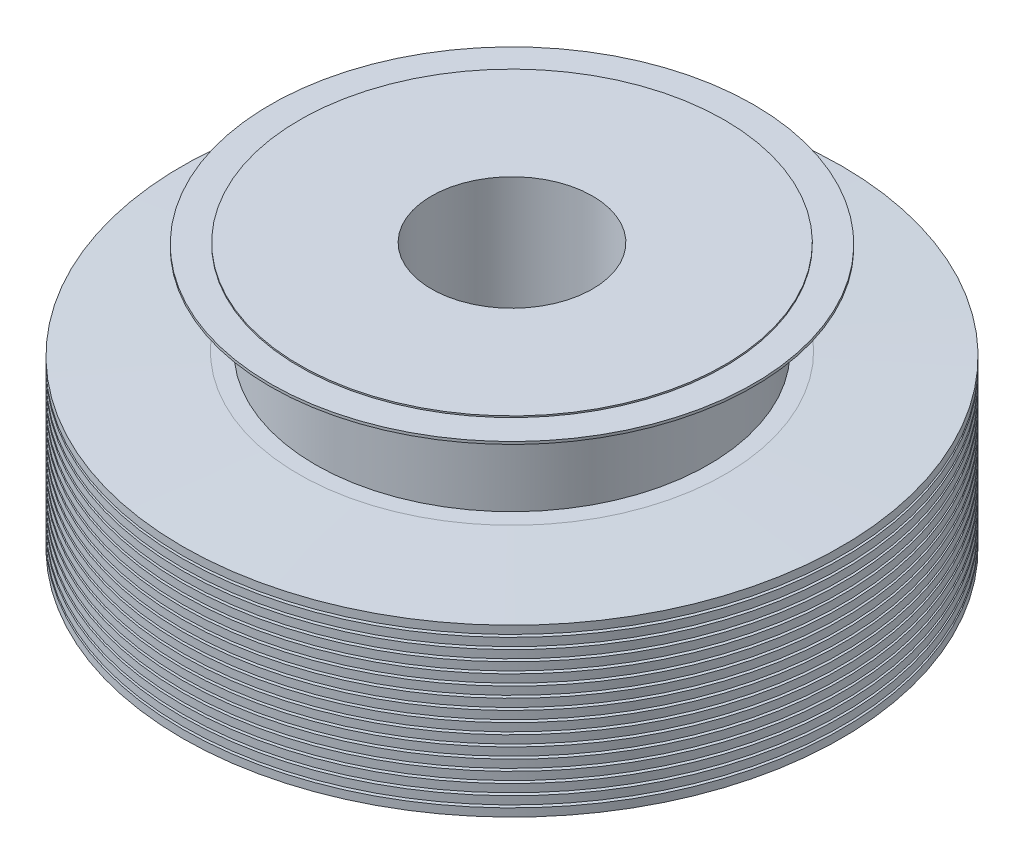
ISO-10303-21;
HEADER;
FILE_DESCRIPTION(('STEP AP214'),'2;1');
FILE_NAME('part.step','',(''),(''),'','','');
FILE_SCHEMA(('AUTOMOTIVE_DESIGN { 1 0 10303 214 1 1 1 1 }'));
ENDSEC;
DATA;
#1=APPLICATION_CONTEXT('core data for automotive mechanical design processes');
#2=APPLICATION_PROTOCOL_DEFINITION('international standard','automotive_design',2000,#1);
#3=PRODUCT_CONTEXT('',#1,'mechanical');
#4=PRODUCT('Part','Part','',(#3));
#5=PRODUCT_RELATED_PRODUCT_CATEGORY('part','',(#4));
#6=PRODUCT_DEFINITION_FORMATION('','',#4);
#7=PRODUCT_DEFINITION_CONTEXT('part definition',#1,'design');
#8=PRODUCT_DEFINITION('design','',#6,#7);
#9=PRODUCT_DEFINITION_SHAPE('','',#8);
#10=(LENGTH_UNIT() NAMED_UNIT(*) SI_UNIT(.MILLI.,.METRE.));
#11=(NAMED_UNIT(*) PLANE_ANGLE_UNIT() SI_UNIT($,.RADIAN.));
#12=(NAMED_UNIT(*) SI_UNIT($,.STERADIAN.) SOLID_ANGLE_UNIT());
#13=UNCERTAINTY_MEASURE_WITH_UNIT(LENGTH_MEASURE(1.E-05),#10,'distance_accuracy_value','');
#14=(GEOMETRIC_REPRESENTATION_CONTEXT(3) GLOBAL_UNCERTAINTY_ASSIGNED_CONTEXT((#13)) GLOBAL_UNIT_ASSIGNED_CONTEXT((#10,
#11,#12)) REPRESENTATION_CONTEXT('',''));
#15=CARTESIAN_POINT('',(0.,0.,0.));
#16=DIRECTION('',(0.,0.,1.));
#17=DIRECTION('',(1.,0.,0.));
#18=AXIS2_PLACEMENT_3D('',#15,#16,#17);
#19=CARTESIAN_POINT('',(23.35,0.,0.));
#20=DIRECTION('',(0.,1.,0.));
#21=DIRECTION('',(1.,0.,0.));
#22=AXIS2_PLACEMENT_3D('',#19,#20,#21);
#23=PLANE('',#22);
#24=CARTESIAN_POINT('',(0.,0.,0.));
#25=DIRECTION('',(0.,-1.,0.));
#26=DIRECTION('',(0.,0.,-1.));
#27=AXIS2_PLACEMENT_3D('',#24,#25,#26);
#28=CIRCLE('',#27,23.35);
#29=CARTESIAN_POINT('',(0.,0.,-23.35));
#30=VERTEX_POINT('',#29);
#31=EDGE_CURVE('E11',#30,#30,#28,.T.);
#32=ORIENTED_EDGE('',*,*,#31,.T.);
#33=EDGE_LOOP('',(#32));
#34=FACE_BOUND('',#33,.T.);
#35=CARTESIAN_POINT('',(0.,0.,0.));
#36=DIRECTION('',(0.,-1.,0.));
#37=DIRECTION('',(0.,0.,-1.));
#38=AXIS2_PLACEMENT_3D('',#35,#36,#37);
#39=CIRCLE('',#38,11.);
#40=CARTESIAN_POINT('',(0.,0.,-11.));
#41=VERTEX_POINT('',#40);
#42=EDGE_CURVE('E402',#41,#41,#39,.T.);
#43=ORIENTED_EDGE('',*,*,#42,.F.);
#44=EDGE_LOOP('',(#43));
#45=FACE_BOUND('',#44,.T.);
#46=ADVANCED_FACE('F16',(#34,#45),#23,.F.);
#47=CARTESIAN_POINT('',(0.,0.,0.));
#48=DIRECTION('',(0.,1.,0.));
#49=DIRECTION('',(0.,0.,-1.));
#50=AXIS2_PLACEMENT_3D('',#47,#48,#49);
#51=CYLINDRICAL_SURFACE('',#50,23.35);
#52=CARTESIAN_POINT('',(0.,0.7,0.));
#53=DIRECTION('',(0.,-1.,0.));
#54=DIRECTION('',(0.,0.,-1.));
#55=AXIS2_PLACEMENT_3D('',#52,#53,#54);
#56=CIRCLE('',#55,23.35);
#57=CARTESIAN_POINT('',(0.,0.7,-23.35));
#58=VERTEX_POINT('',#57);
#59=EDGE_CURVE('E27',#58,#58,#56,.T.);
#60=ORIENTED_EDGE('',*,*,#59,.T.);
#61=EDGE_LOOP('',(#60));
#62=FACE_BOUND('',#61,.T.);
#63=ORIENTED_EDGE('',*,*,#31,.F.);
#64=EDGE_LOOP('',(#63));
#65=FACE_BOUND('',#64,.T.);
#66=ADVANCED_FACE('F490',(#62,#65),#51,.T.);
#67=CARTESIAN_POINT('',(22.85,0.7,0.));
#68=DIRECTION('',(0.,-1.,0.));
#69=DIRECTION('',(0.,0.,-1.));
#70=AXIS2_PLACEMENT_3D('',#67,#68,#69);
#71=PLANE('',#70);
#72=ORIENTED_EDGE('',*,*,#59,.F.);
#73=EDGE_LOOP('',(#72));
#74=FACE_BOUND('',#73,.T.);
#75=CARTESIAN_POINT('',(0.,0.7,0.));
#76=DIRECTION('',(0.,-1.,0.));
#77=DIRECTION('',(0.,0.,-1.));
#78=AXIS2_PLACEMENT_3D('',#75,#76,#77);
#79=CIRCLE('',#78,22.85);
#80=CARTESIAN_POINT('',(0.,0.7,-22.85));
#81=VERTEX_POINT('',#80);
#82=EDGE_CURVE('E317',#81,#81,#79,.T.);
#83=ORIENTED_EDGE('',*,*,#82,.T.);
#84=EDGE_LOOP('',(#83));
#85=FACE_BOUND('',#84,.T.);
#86=ADVANCED_FACE('F474',(#74,#85),#71,.F.);
#87=CARTESIAN_POINT('',(0.,0.,0.));
#88=DIRECTION('',(0.,1.,0.));
#89=DIRECTION('',(0.,0.,-1.));
#90=AXIS2_PLACEMENT_3D('',#87,#88,#89);
#91=CYLINDRICAL_SURFACE('',#90,22.85);
#92=CARTESIAN_POINT('',(0.,14.14,0.));
#93=DIRECTION('',(0.,-1.,0.));
#94=DIRECTION('',(0.,0.,-1.));
#95=AXIS2_PLACEMENT_3D('',#92,#93,#94);
#96=CIRCLE('',#95,22.85);
#97=CARTESIAN_POINT('',(0.,14.14,-22.85));
#98=VERTEX_POINT('',#97);
#99=EDGE_CURVE('E443',#98,#98,#96,.T.);
#100=ORIENTED_EDGE('',*,*,#99,.T.);
#101=EDGE_LOOP('',(#100));
#102=FACE_BOUND('',#101,.T.);
#103=ORIENTED_EDGE('',*,*,#82,.F.);
#104=EDGE_LOOP('',(#103));
#105=FACE_BOUND('',#104,.T.);
#106=ADVANCED_FACE('F476',(#102,#105),#91,.T.);
#107=CARTESIAN_POINT('',(0.,14.6,0.));
#108=DIRECTION('',(0.,1.,0.));
#109=DIRECTION('',(0.,0.,1.));
#110=AXIS2_PLACEMENT_3D('',#107,#108,#109);
#111=CONICAL_SURFACE('',#110,23.31,0.7853981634);
#112=CARTESIAN_POINT('',(0.,14.6,0.));
#113=DIRECTION('',(0.,-1.,0.));
#114=DIRECTION('',(0.,0.,-1.));
#115=AXIS2_PLACEMENT_3D('',#112,#113,#114);
#116=CIRCLE('',#115,23.31);
#117=CARTESIAN_POINT('',(0.,14.6,-23.31));
#118=VERTEX_POINT('',#117);
#119=EDGE_CURVE('E322',#118,#118,#116,.T.);
#120=ORIENTED_EDGE('',*,*,#119,.T.);
#121=EDGE_LOOP('',(#120));
#122=FACE_BOUND('',#121,.T.);
#123=ORIENTED_EDGE('',*,*,#99,.F.);
#124=EDGE_LOOP('',(#123));
#125=FACE_BOUND('',#124,.T.);
#126=ADVANCED_FACE('F478',(#122,#125),#111,.T.);
#127=CARTESIAN_POINT('',(24.85,14.6,0.));
#128=DIRECTION('',(0.,1.,0.));
#129=DIRECTION('',(1.,0.,0.));
#130=AXIS2_PLACEMENT_3D('',#127,#128,#129);
#131=PLANE('',#130);
#132=CARTESIAN_POINT('',(0.,14.6,0.));
#133=DIRECTION('',(0.,-1.,0.));
#134=DIRECTION('',(0.,0.,-1.));
#135=AXIS2_PLACEMENT_3D('',#132,#133,#134);
#136=CIRCLE('',#135,24.85);
#137=CARTESIAN_POINT('',(0.,14.6,-24.85));
#138=VERTEX_POINT('',#137);
#139=EDGE_CURVE('E318',#138,#138,#136,.T.);
#140=ORIENTED_EDGE('',*,*,#139,.T.);
#141=EDGE_LOOP('',(#140));
#142=FACE_BOUND('',#141,.T.);
#143=ORIENTED_EDGE('',*,*,#119,.F.);
#144=EDGE_LOOP('',(#143));
#145=FACE_BOUND('',#144,.T.);
#146=ADVANCED_FACE('F487',(#142,#145),#131,.F.);
#147=CARTESIAN_POINT('',(0.,0.,0.));
#148=DIRECTION('',(0.,1.,0.));
#149=DIRECTION('',(0.,0.,-1.));
#150=AXIS2_PLACEMENT_3D('',#147,#148,#149);
#151=CYLINDRICAL_SURFACE('',#150,24.85);
#152=CARTESIAN_POINT('',(0.,14.8,0.));
#153=DIRECTION('',(0.,-1.,0.));
#154=DIRECTION('',(0.,0.,-1.));
#155=AXIS2_PLACEMENT_3D('',#152,#153,#154);
#156=CIRCLE('',#155,24.85);
#157=CARTESIAN_POINT('',(0.,14.8,-24.85));
#158=VERTEX_POINT('',#157);
#159=EDGE_CURVE('E323',#158,#158,#156,.T.);
#160=ORIENTED_EDGE('',*,*,#159,.T.);
#161=EDGE_LOOP('',(#160));
#162=FACE_BOUND('',#161,.T.);
#163=ORIENTED_EDGE('',*,*,#139,.F.);
#164=EDGE_LOOP('',(#163));
#165=FACE_BOUND('',#164,.T.);
#166=ADVANCED_FACE('F571',(#162,#165),#151,.T.);
#167=CARTESIAN_POINT('',(0.,38.3,0.));
#168=DIRECTION('',(0.,-1.,0.));
#169=DIRECTION('',(0.,0.,-1.));
#170=AXIS2_PLACEMENT_3D('',#167,#168,#169);
#171=PLANE('',#170);
#172=CARTESIAN_POINT('',(0.,38.3,0.));
#173=DIRECTION('',(0.,-1.,0.));
#174=DIRECTION('',(0.,0.,-1.));
#175=AXIS2_PLACEMENT_3D('',#172,#173,#174);
#176=CIRCLE('',#175,29.123631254);
#177=CARTESIAN_POINT('',(0.,38.3,-29.1236312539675));
#178=VERTEX_POINT('',#177);
#179=EDGE_CURVE('E291',#178,#178,#176,.T.);
#180=ORIENTED_EDGE('',*,*,#179,.F.);
#181=EDGE_LOOP('',(#180));
#182=FACE_BOUND('',#181,.T.);
#183=CARTESIAN_POINT('',(0.,38.3,0.));
#184=DIRECTION('',(0.,-1.,0.));
#185=DIRECTION('',(0.,0.,-1.));
#186=AXIS2_PLACEMENT_3D('',#183,#184,#185);
#187=CIRCLE('',#186,26.85);
#188=CARTESIAN_POINT('',(0.,38.3,-26.85));
#189=VERTEX_POINT('',#188);
#190=EDGE_CURVE('E407',#189,#189,#187,.T.);
#191=ORIENTED_EDGE('',*,*,#190,.T.);
#192=EDGE_LOOP('',(#191));
#193=FACE_BOUND('',#192,.T.);
#194=ADVANCED_FACE('F574',(#182,#193),#171,.F.);
#195=CARTESIAN_POINT('',(0.,38.3,0.));
#196=DIRECTION('',(0.,-1.,0.));
#197=DIRECTION('',(0.,0.,-1.));
#198=AXIS2_PLACEMENT_3D('',#195,#196,#197);
#199=CONICAL_SURFACE('',#198,29.123631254,1.5336512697);
#200=CARTESIAN_POINT('',(0.,37.71,0.));
#201=DIRECTION('',(0.,-1.,0.));
#202=DIRECTION('',(0.,0.,-1.));
#203=AXIS2_PLACEMENT_3D('',#200,#201,#202);
#204=CIRCLE('',#203,45.);
#205=CARTESIAN_POINT('',(0.,37.71,-45.));
#206=VERTEX_POINT('',#205);
#207=EDGE_CURVE('E287',#206,#206,#204,.T.);
#208=ORIENTED_EDGE('',*,*,#207,.F.);
#209=EDGE_LOOP('',(#208));
#210=FACE_BOUND('',#209,.T.);
#211=ORIENTED_EDGE('',*,*,#179,.T.);
#212=EDGE_LOOP('',(#211));
#213=FACE_BOUND('',#212,.T.);
#214=ADVANCED_FACE('F723',(#210,#213),#199,.T.);
#215=CARTESIAN_POINT('',(0.,14.8,0.));
#216=DIRECTION('',(0.,1.,0.));
#217=DIRECTION('',(0.,0.,-1.));
#218=AXIS2_PLACEMENT_3D('',#215,#216,#217);
#219=CYLINDRICAL_SURFACE('',#218,45.);
#220=ORIENTED_EDGE('',*,*,#207,.T.);
#221=EDGE_LOOP('',(#220));
#222=FACE_BOUND('',#221,.T.);
#223=CARTESIAN_POINT('',(0.,36.6187489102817,0.));
#224=DIRECTION('',(0.,-1.,0.));
#225=DIRECTION('',(0.,0.,-1.));
#226=AXIS2_PLACEMENT_3D('',#223,#224,#225);
#227=CIRCLE('',#226,45.);
#228=CARTESIAN_POINT('',(0.,36.6187489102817,-45.));
#229=VERTEX_POINT('',#228);
#230=EDGE_CURVE('E292',#229,#229,#227,.T.);
#231=ORIENTED_EDGE('',*,*,#230,.F.);
#232=EDGE_LOOP('',(#231));
#233=FACE_BOUND('',#232,.T.);
#234=ADVANCED_FACE('F732',(#222,#233),#219,.T.);
#235=CARTESIAN_POINT('',(0.,36.6187489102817,0.));
#236=DIRECTION('',(0.,1.,0.));
#237=DIRECTION('',(0.,0.,1.));
#238=AXIS2_PLACEMENT_3D('',#235,#236,#237);
#239=CONICAL_SURFACE('',#238,45.,1.5599407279);
#240=ORIENTED_EDGE('',*,*,#230,.T.);
#241=EDGE_LOOP('',(#240));
#242=FACE_BOUND('',#241,.T.);
#243=CARTESIAN_POINT('',(0.,36.4443744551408,0.));
#244=DIRECTION('',(0.,-1.,0.));
#245=DIRECTION('',(0.,0.,-1.));
#246=AXIS2_PLACEMENT_3D('',#243,#244,#245);
#247=CIRCLE('',#246,28.9375416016);
#248=CARTESIAN_POINT('',(0.,36.4443744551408,-28.9375416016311));
#249=VERTEX_POINT('',#248);
#250=EDGE_CURVE('E340',#249,#249,#247,.T.);
#251=ORIENTED_EDGE('',*,*,#250,.F.);
#252=EDGE_LOOP('',(#251));
#253=FACE_BOUND('',#252,.T.);
#254=ADVANCED_FACE('F729',(#242,#253),#239,.T.);
#255=CARTESIAN_POINT('',(0.,36.4443744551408,0.));
#256=DIRECTION('',(0.,-1.,0.));
#257=DIRECTION('',(0.,0.,-1.));
#258=AXIS2_PLACEMENT_3D('',#255,#256,#257);
#259=CONICAL_SURFACE('',#258,28.9375416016,1.5599407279);
#260=CARTESIAN_POINT('',(0.,36.27,0.));
#261=DIRECTION('',(0.,-1.,0.));
#262=DIRECTION('',(0.,0.,-1.));
#263=AXIS2_PLACEMENT_3D('',#260,#261,#262);
#264=CIRCLE('',#263,45.);
#265=CARTESIAN_POINT('',(0.,36.27,-45.));
#266=VERTEX_POINT('',#265);
#267=EDGE_CURVE('E397',#266,#266,#264,.T.);
#268=ORIENTED_EDGE('',*,*,#267,.F.);
#269=EDGE_LOOP('',(#268));
#270=FACE_BOUND('',#269,.T.);
#271=ORIENTED_EDGE('',*,*,#250,.T.);
#272=EDGE_LOOP('',(#271));
#273=FACE_BOUND('',#272,.T.);
#274=ADVANCED_FACE('F727',(#270,#273),#259,.T.);
#275=CARTESIAN_POINT('',(0.,14.8,0.));
#276=DIRECTION('',(0.,1.,0.));
#277=DIRECTION('',(0.,0.,-1.));
#278=AXIS2_PLACEMENT_3D('',#275,#276,#277);
#279=CYLINDRICAL_SURFACE('',#278,45.);
#280=ORIENTED_EDGE('',*,*,#267,.T.);
#281=EDGE_LOOP('',(#280));
#282=FACE_BOUND('',#281,.T.);
#283=CARTESIAN_POINT('',(0.,35.1787489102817,0.));
#284=DIRECTION('',(0.,-1.,0.));
#285=DIRECTION('',(0.,0.,-1.));
#286=AXIS2_PLACEMENT_3D('',#283,#284,#285);
#287=CIRCLE('',#286,45.);
#288=CARTESIAN_POINT('',(0.,35.1787489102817,-45.));
#289=VERTEX_POINT('',#288);
#290=EDGE_CURVE('E417',#289,#289,#287,.T.);
#291=ORIENTED_EDGE('',*,*,#290,.F.);
#292=EDGE_LOOP('',(#291));
#293=FACE_BOUND('',#292,.T.);
#294=ADVANCED_FACE('F584',(#282,#293),#279,.T.);
#295=CARTESIAN_POINT('',(0.,35.1787489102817,0.));
#296=DIRECTION('',(0.,1.,0.));
#297=DIRECTION('',(0.,0.,1.));
#298=AXIS2_PLACEMENT_3D('',#295,#296,#297);
#299=CONICAL_SURFACE('',#298,45.,1.5599407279);
#300=ORIENTED_EDGE('',*,*,#290,.T.);
#301=EDGE_LOOP('',(#300));
#302=FACE_BOUND('',#301,.T.);
#303=CARTESIAN_POINT('',(0.,35.0043744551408,0.));
#304=DIRECTION('',(0.,-1.,0.));
#305=DIRECTION('',(0.,0.,-1.));
#306=AXIS2_PLACEMENT_3D('',#303,#304,#305);
#307=CIRCLE('',#306,28.9375416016);
#308=CARTESIAN_POINT('',(0.,35.0043744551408,-28.9375416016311));
#309=VERTEX_POINT('',#308);
#310=EDGE_CURVE('E366',#309,#309,#307,.T.);
#311=ORIENTED_EDGE('',*,*,#310,.F.);
#312=EDGE_LOOP('',(#311));
#313=FACE_BOUND('',#312,.T.);
#314=ADVANCED_FACE('F581',(#302,#313),#299,.T.);
#315=CARTESIAN_POINT('',(0.,35.0043744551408,0.));
#316=DIRECTION('',(0.,-1.,0.));
#317=DIRECTION('',(0.,0.,-1.));
#318=AXIS2_PLACEMENT_3D('',#315,#316,#317);
#319=CONICAL_SURFACE('',#318,28.9375416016,1.5599407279);
#320=CARTESIAN_POINT('',(0.,34.83,0.));
#321=DIRECTION('',(0.,-1.,0.));
#322=DIRECTION('',(0.,0.,-1.));
#323=AXIS2_PLACEMENT_3D('',#320,#321,#322);
#324=CIRCLE('',#323,45.);
#325=CARTESIAN_POINT('',(0.,34.83,-45.));
#326=VERTEX_POINT('',#325);
#327=EDGE_CURVE('E362',#326,#326,#324,.T.);
#328=ORIENTED_EDGE('',*,*,#327,.F.);
#329=EDGE_LOOP('',(#328));
#330=FACE_BOUND('',#329,.T.);
#331=ORIENTED_EDGE('',*,*,#310,.T.);
#332=EDGE_LOOP('',(#331));
#333=FACE_BOUND('',#332,.T.);
#334=ADVANCED_FACE('F569',(#330,#333),#319,.T.);
#335=CARTESIAN_POINT('',(0.,14.8,0.));
#336=DIRECTION('',(0.,1.,0.));
#337=DIRECTION('',(0.,0.,-1.));
#338=AXIS2_PLACEMENT_3D('',#335,#336,#337);
#339=CYLINDRICAL_SURFACE('',#338,45.);
#340=ORIENTED_EDGE('',*,*,#327,.T.);
#341=EDGE_LOOP('',(#340));
#342=FACE_BOUND('',#341,.T.);
#343=CARTESIAN_POINT('',(0.,33.7387489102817,0.));
#344=DIRECTION('',(0.,-1.,0.));
#345=DIRECTION('',(0.,0.,-1.));
#346=AXIS2_PLACEMENT_3D('',#343,#344,#345);
#347=CIRCLE('',#346,45.);
#348=CARTESIAN_POINT('',(0.,33.7387489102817,-45.));
#349=VERTEX_POINT('',#348);
#350=EDGE_CURVE('E367',#349,#349,#347,.T.);
#351=ORIENTED_EDGE('',*,*,#350,.F.);
#352=EDGE_LOOP('',(#351));
#353=FACE_BOUND('',#352,.T.);
#354=ADVANCED_FACE('F565',(#342,#353),#339,.T.);
#355=CARTESIAN_POINT('',(0.,33.7387489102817,0.));
#356=DIRECTION('',(0.,1.,0.));
#357=DIRECTION('',(0.,0.,1.));
#358=AXIS2_PLACEMENT_3D('',#355,#356,#357);
#359=CONICAL_SURFACE('',#358,45.,1.5599407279);
#360=ORIENTED_EDGE('',*,*,#350,.T.);
#361=EDGE_LOOP('',(#360));
#362=FACE_BOUND('',#361,.T.);
#363=CARTESIAN_POINT('',(0.,33.5643744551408,0.));
#364=DIRECTION('',(0.,-1.,0.));
#365=DIRECTION('',(0.,0.,-1.));
#366=AXIS2_PLACEMENT_3D('',#363,#364,#365);
#367=CIRCLE('',#366,28.9375416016);
#368=CARTESIAN_POINT('',(0.,33.5643744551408,-28.9375416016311));
#369=VERTEX_POINT('',#368);
#370=EDGE_CURVE('E246',#369,#369,#367,.T.);
#371=ORIENTED_EDGE('',*,*,#370,.F.);
#372=EDGE_LOOP('',(#371));
#373=FACE_BOUND('',#372,.T.);
#374=ADVANCED_FACE('F568',(#362,#373),#359,.T.);
#375=CARTESIAN_POINT('',(0.,33.5643744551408,0.));
#376=DIRECTION('',(0.,-1.,0.));
#377=DIRECTION('',(0.,0.,-1.));
#378=AXIS2_PLACEMENT_3D('',#375,#376,#377);
#379=CONICAL_SURFACE('',#378,28.9375416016,1.5599407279);
#380=CARTESIAN_POINT('',(0.,33.39,0.));
#381=DIRECTION('',(0.,-1.,0.));
#382=DIRECTION('',(0.,0.,-1.));
#383=AXIS2_PLACEMENT_3D('',#380,#381,#382);
#384=CIRCLE('',#383,45.);
#385=CARTESIAN_POINT('',(0.,33.39,-45.));
#386=VERTEX_POINT('',#385);
#387=EDGE_CURVE('E237',#386,#386,#384,.T.);
#388=ORIENTED_EDGE('',*,*,#387,.F.);
#389=EDGE_LOOP('',(#388));
#390=FACE_BOUND('',#389,.T.);
#391=ORIENTED_EDGE('',*,*,#370,.T.);
#392=EDGE_LOOP('',(#391));
#393=FACE_BOUND('',#392,.T.);
#394=ADVANCED_FACE('F586',(#390,#393),#379,.T.);
#395=CARTESIAN_POINT('',(0.,14.8,0.));
#396=DIRECTION('',(0.,1.,0.));
#397=DIRECTION('',(0.,0.,-1.));
#398=AXIS2_PLACEMENT_3D('',#395,#396,#397);
#399=CYLINDRICAL_SURFACE('',#398,45.);
#400=ORIENTED_EDGE('',*,*,#387,.T.);
#401=EDGE_LOOP('',(#400));
#402=FACE_BOUND('',#401,.T.);
#403=CARTESIAN_POINT('',(0.,32.2987489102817,0.));
#404=DIRECTION('',(0.,-1.,0.));
#405=DIRECTION('',(0.,0.,-1.));
#406=AXIS2_PLACEMENT_3D('',#403,#404,#405);
#407=CIRCLE('',#406,45.);
#408=CARTESIAN_POINT('',(0.,32.2987489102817,-45.));
#409=VERTEX_POINT('',#408);
#410=EDGE_CURVE('E312',#409,#409,#407,.T.);
#411=ORIENTED_EDGE('',*,*,#410,.F.);
#412=EDGE_LOOP('',(#411));
#413=FACE_BOUND('',#412,.T.);
#414=ADVANCED_FACE('F589',(#402,#413),#399,.T.);
#415=CARTESIAN_POINT('',(0.,32.2987489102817,0.));
#416=DIRECTION('',(0.,1.,0.));
#417=DIRECTION('',(0.,0.,1.));
#418=AXIS2_PLACEMENT_3D('',#415,#416,#417);
#419=CONICAL_SURFACE('',#418,45.,1.5599407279);
#420=ORIENTED_EDGE('',*,*,#410,.T.);
#421=EDGE_LOOP('',(#420));
#422=FACE_BOUND('',#421,.T.);
#423=CARTESIAN_POINT('',(0.,32.1243744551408,0.));
#424=DIRECTION('',(0.,-1.,0.));
#425=DIRECTION('',(0.,0.,-1.));
#426=AXIS2_PLACEMENT_3D('',#423,#424,#425);
#427=CIRCLE('',#426,28.9375416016);
#428=CARTESIAN_POINT('',(0.,32.1243744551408,-28.9375416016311));
#429=VERTEX_POINT('',#428);
#430=EDGE_CURVE('E341',#429,#429,#427,.T.);
#431=ORIENTED_EDGE('',*,*,#430,.F.);
#432=EDGE_LOOP('',(#431));
#433=FACE_BOUND('',#432,.T.);
#434=ADVANCED_FACE('F546',(#422,#433),#419,.T.);
#435=CARTESIAN_POINT('',(0.,32.1243744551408,0.));
#436=DIRECTION('',(0.,-1.,0.));
#437=DIRECTION('',(0.,0.,-1.));
#438=AXIS2_PLACEMENT_3D('',#435,#436,#437);
#439=CONICAL_SURFACE('',#438,28.9375416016,1.5599407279);
#440=CARTESIAN_POINT('',(0.,31.95,0.));
#441=DIRECTION('',(0.,-1.,0.));
#442=DIRECTION('',(0.,0.,-1.));
#443=AXIS2_PLACEMENT_3D('',#440,#441,#442);
#444=CIRCLE('',#443,45.);
#445=CARTESIAN_POINT('',(0.,31.95,-45.));
#446=VERTEX_POINT('',#445);
#447=EDGE_CURVE('E345',#446,#446,#444,.T.);
#448=ORIENTED_EDGE('',*,*,#447,.F.);
#449=EDGE_LOOP('',(#448));
#450=FACE_BOUND('',#449,.T.);
#451=ORIENTED_EDGE('',*,*,#430,.T.);
#452=EDGE_LOOP('',(#451));
#453=FACE_BOUND('',#452,.T.);
#454=ADVANCED_FACE('F542',(#450,#453),#439,.T.);
#455=CARTESIAN_POINT('',(0.,14.8,0.));
#456=DIRECTION('',(0.,1.,0.));
#457=DIRECTION('',(0.,0.,-1.));
#458=AXIS2_PLACEMENT_3D('',#455,#456,#457);
#459=CYLINDRICAL_SURFACE('',#458,45.);
#460=ORIENTED_EDGE('',*,*,#447,.T.);
#461=EDGE_LOOP('',(#460));
#462=FACE_BOUND('',#461,.T.);
#463=CARTESIAN_POINT('',(0.,30.8587489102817,0.));
#464=DIRECTION('',(0.,-1.,0.));
#465=DIRECTION('',(0.,0.,-1.));
#466=AXIS2_PLACEMENT_3D('',#463,#464,#465);
#467=CIRCLE('',#466,45.);
#468=CARTESIAN_POINT('',(0.,30.8587489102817,-45.));
#469=VERTEX_POINT('',#468);
#470=EDGE_CURVE('E384',#469,#469,#467,.T.);
#471=ORIENTED_EDGE('',*,*,#470,.F.);
#472=EDGE_LOOP('',(#471));
#473=FACE_BOUND('',#472,.T.);
#474=ADVANCED_FACE('F545',(#462,#473),#459,.T.);
#475=CARTESIAN_POINT('',(0.,30.8587489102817,0.));
#476=DIRECTION('',(0.,1.,0.));
#477=DIRECTION('',(0.,0.,1.));
#478=AXIS2_PLACEMENT_3D('',#475,#476,#477);
#479=CONICAL_SURFACE('',#478,45.,1.5599407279);
#480=ORIENTED_EDGE('',*,*,#470,.T.);
#481=EDGE_LOOP('',(#480));
#482=FACE_BOUND('',#481,.T.);
#483=CARTESIAN_POINT('',(0.,30.6843744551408,0.));
#484=DIRECTION('',(0.,-1.,0.));
#485=DIRECTION('',(0.,0.,-1.));
#486=AXIS2_PLACEMENT_3D('',#483,#484,#485);
#487=CIRCLE('',#486,28.9375416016);
#488=CARTESIAN_POINT('',(0.,30.6843744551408,-28.9375416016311));
#489=VERTEX_POINT('',#488);
#490=EDGE_CURVE('E372',#489,#489,#487,.T.);
#491=ORIENTED_EDGE('',*,*,#490,.F.);
#492=EDGE_LOOP('',(#491));
#493=FACE_BOUND('',#492,.T.);
#494=ADVANCED_FACE('F563',(#482,#493),#479,.T.);
#495=CARTESIAN_POINT('',(0.,30.6843744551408,0.));
#496=DIRECTION('',(0.,-1.,0.));
#497=DIRECTION('',(0.,0.,-1.));
#498=AXIS2_PLACEMENT_3D('',#495,#496,#497);
#499=CONICAL_SURFACE('',#498,28.9375416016,1.5599407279);
#500=CARTESIAN_POINT('',(0.,30.51,0.));
#501=DIRECTION('',(0.,-1.,0.));
#502=DIRECTION('',(0.,0.,-1.));
#503=AXIS2_PLACEMENT_3D('',#500,#501,#502);
#504=CIRCLE('',#503,45.);
#505=CARTESIAN_POINT('',(0.,30.51,-45.));
#506=VERTEX_POINT('',#505);
#507=EDGE_CURVE('E368',#506,#506,#504,.T.);
#508=ORIENTED_EDGE('',*,*,#507,.F.);
#509=EDGE_LOOP('',(#508));
#510=FACE_BOUND('',#509,.T.);
#511=ORIENTED_EDGE('',*,*,#490,.T.);
#512=EDGE_LOOP('',(#511));
#513=FACE_BOUND('',#512,.T.);
#514=ADVANCED_FACE('F559',(#510,#513),#499,.T.);
#515=CARTESIAN_POINT('',(0.,14.8,0.));
#516=DIRECTION('',(0.,1.,0.));
#517=DIRECTION('',(0.,0.,-1.));
#518=AXIS2_PLACEMENT_3D('',#515,#516,#517);
#519=CYLINDRICAL_SURFACE('',#518,45.);
#520=ORIENTED_EDGE('',*,*,#507,.T.);
#521=EDGE_LOOP('',(#520));
#522=FACE_BOUND('',#521,.T.);
#523=CARTESIAN_POINT('',(0.,29.4187489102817,0.));
#524=DIRECTION('',(0.,-1.,0.));
#525=DIRECTION('',(0.,0.,-1.));
#526=AXIS2_PLACEMENT_3D('',#523,#524,#525);
#527=CIRCLE('',#526,45.);
#528=CARTESIAN_POINT('',(0.,29.4187489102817,-45.));
#529=VERTEX_POINT('',#528);
#530=EDGE_CURVE('E373',#529,#529,#527,.T.);
#531=ORIENTED_EDGE('',*,*,#530,.F.);
#532=EDGE_LOOP('',(#531));
#533=FACE_BOUND('',#532,.T.);
#534=ADVANCED_FACE('F562',(#522,#533),#519,.T.);
#535=CARTESIAN_POINT('',(0.,29.4187489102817,0.));
#536=DIRECTION('',(0.,1.,0.));
#537=DIRECTION('',(0.,0.,1.));
#538=AXIS2_PLACEMENT_3D('',#535,#536,#537);
#539=CONICAL_SURFACE('',#538,45.,1.5599407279);
#540=ORIENTED_EDGE('',*,*,#530,.T.);
#541=EDGE_LOOP('',(#540));
#542=FACE_BOUND('',#541,.T.);
#543=CARTESIAN_POINT('',(0.,29.2443744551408,0.));
#544=DIRECTION('',(0.,-1.,0.));
#545=DIRECTION('',(0.,0.,-1.));
#546=AXIS2_PLACEMENT_3D('',#543,#544,#545);
#547=CIRCLE('',#546,28.9375416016);
#548=CARTESIAN_POINT('',(0.,29.2443744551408,-28.9375416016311));
#549=VERTEX_POINT('',#548);
#550=EDGE_CURVE('E357',#549,#549,#547,.T.);
#551=ORIENTED_EDGE('',*,*,#550,.F.);
#552=EDGE_LOOP('',(#551));
#553=FACE_BOUND('',#552,.T.);
#554=ADVANCED_FACE('F536',(#542,#553),#539,.T.);
#555=CARTESIAN_POINT('',(0.,29.2443744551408,0.));
#556=DIRECTION('',(0.,-1.,0.));
#557=DIRECTION('',(0.,0.,-1.));
#558=AXIS2_PLACEMENT_3D('',#555,#556,#557);
#559=CONICAL_SURFACE('',#558,28.9375416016,1.5599407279);
#560=CARTESIAN_POINT('',(0.,29.07,0.));
#561=DIRECTION('',(0.,-1.,0.));
#562=DIRECTION('',(0.,0.,-1.));
#563=AXIS2_PLACEMENT_3D('',#560,#561,#562);
#564=CIRCLE('',#563,45.);
#565=CARTESIAN_POINT('',(0.,29.07,-45.));
#566=VERTEX_POINT('',#565);
#567=EDGE_CURVE('E353',#566,#566,#564,.T.);
#568=ORIENTED_EDGE('',*,*,#567,.F.);
#569=EDGE_LOOP('',(#568));
#570=FACE_BOUND('',#569,.T.);
#571=ORIENTED_EDGE('',*,*,#550,.T.);
#572=EDGE_LOOP('',(#571));
#573=FACE_BOUND('',#572,.T.);
#574=ADVANCED_FACE('F532',(#570,#573),#559,.T.);
#575=CARTESIAN_POINT('',(0.,14.8,0.));
#576=DIRECTION('',(0.,1.,0.));
#577=DIRECTION('',(0.,0.,-1.));
#578=AXIS2_PLACEMENT_3D('',#575,#576,#577);
#579=CYLINDRICAL_SURFACE('',#578,45.);
#580=ORIENTED_EDGE('',*,*,#567,.T.);
#581=EDGE_LOOP('',(#580));
#582=FACE_BOUND('',#581,.T.);
#583=CARTESIAN_POINT('',(0.,27.9787489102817,0.));
#584=DIRECTION('',(0.,-1.,0.));
#585=DIRECTION('',(0.,0.,-1.));
#586=AXIS2_PLACEMENT_3D('',#583,#584,#585);
#587=CIRCLE('',#586,45.);
#588=CARTESIAN_POINT('',(0.,27.9787489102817,-45.));
#589=VERTEX_POINT('',#588);
#590=EDGE_CURVE('E358',#589,#589,#587,.T.);
#591=ORIENTED_EDGE('',*,*,#590,.F.);
#592=EDGE_LOOP('',(#591));
#593=FACE_BOUND('',#592,.T.);
#594=ADVANCED_FACE('F535',(#582,#593),#579,.T.);
#595=CARTESIAN_POINT('',(0.,27.9787489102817,0.));
#596=DIRECTION('',(0.,1.,0.));
#597=DIRECTION('',(0.,0.,1.));
#598=AXIS2_PLACEMENT_3D('',#595,#596,#597);
#599=CONICAL_SURFACE('',#598,45.,1.5599407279);
#600=ORIENTED_EDGE('',*,*,#590,.T.);
#601=EDGE_LOOP('',(#600));
#602=FACE_BOUND('',#601,.T.);
#603=CARTESIAN_POINT('',(0.,27.8043744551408,0.));
#604=DIRECTION('',(0.,-1.,0.));
#605=DIRECTION('',(0.,0.,-1.));
#606=AXIS2_PLACEMENT_3D('',#603,#604,#605);
#607=CIRCLE('',#606,28.9375416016);
#608=CARTESIAN_POINT('',(0.,27.8043744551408,-28.9375416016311));
#609=VERTEX_POINT('',#608);
#610=EDGE_CURVE('E380',#609,#609,#607,.T.);
#611=ORIENTED_EDGE('',*,*,#610,.F.);
#612=EDGE_LOOP('',(#611));
#613=FACE_BOUND('',#612,.T.);
#614=ADVANCED_FACE('F711',(#602,#613),#599,.T.);
#615=CARTESIAN_POINT('',(0.,27.8043744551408,0.));
#616=DIRECTION('',(0.,-1.,0.));
#617=DIRECTION('',(0.,0.,-1.));
#618=AXIS2_PLACEMENT_3D('',#615,#616,#617);
#619=CONICAL_SURFACE('',#618,28.9375416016,1.5599407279);
#620=CARTESIAN_POINT('',(0.,27.63,0.));
#621=DIRECTION('',(0.,-1.,0.));
#622=DIRECTION('',(0.,0.,-1.));
#623=AXIS2_PLACEMENT_3D('',#620,#621,#622);
#624=CIRCLE('',#623,45.);
#625=CARTESIAN_POINT('',(0.,27.63,-45.));
#626=VERTEX_POINT('',#625);
#627=EDGE_CURVE('E297',#626,#626,#624,.T.);
#628=ORIENTED_EDGE('',*,*,#627,.F.);
#629=EDGE_LOOP('',(#628));
#630=FACE_BOUND('',#629,.T.);
#631=ORIENTED_EDGE('',*,*,#610,.T.);
#632=EDGE_LOOP('',(#631));
#633=FACE_BOUND('',#632,.T.);
#634=ADVANCED_FACE('F687',(#630,#633),#619,.T.);
#635=CARTESIAN_POINT('',(0.,14.8,0.));
#636=DIRECTION('',(0.,1.,0.));
#637=DIRECTION('',(0.,0.,-1.));
#638=AXIS2_PLACEMENT_3D('',#635,#636,#637);
#639=CYLINDRICAL_SURFACE('',#638,45.);
#640=ORIENTED_EDGE('',*,*,#627,.T.);
#641=EDGE_LOOP('',(#640));
#642=FACE_BOUND('',#641,.T.);
#643=CARTESIAN_POINT('',(0.,26.5387489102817,0.));
#644=DIRECTION('',(0.,-1.,0.));
#645=DIRECTION('',(0.,0.,-1.));
#646=AXIS2_PLACEMENT_3D('',#643,#644,#645);
#647=CIRCLE('',#646,45.);
#648=CARTESIAN_POINT('',(0.,26.5387489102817,-45.));
#649=VERTEX_POINT('',#648);
#650=EDGE_CURVE('E293',#649,#649,#647,.T.);
#651=ORIENTED_EDGE('',*,*,#650,.F.);
#652=EDGE_LOOP('',(#651));
#653=FACE_BOUND('',#652,.T.);
#654=ADVANCED_FACE('F668',(#642,#653),#639,.T.);
#655=CARTESIAN_POINT('',(0.,26.5387489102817,0.));
#656=DIRECTION('',(0.,1.,0.));
#657=DIRECTION('',(0.,0.,1.));
#658=AXIS2_PLACEMENT_3D('',#655,#656,#657);
#659=CONICAL_SURFACE('',#658,45.,1.5599407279);
#660=ORIENTED_EDGE('',*,*,#650,.T.);
#661=EDGE_LOOP('',(#660));
#662=FACE_BOUND('',#661,.T.);
#663=CARTESIAN_POINT('',(0.,26.3643744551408,0.));
#664=DIRECTION('',(0.,-1.,0.));
#665=DIRECTION('',(0.,0.,-1.));
#666=AXIS2_PLACEMENT_3D('',#663,#664,#665);
#667=CIRCLE('',#666,28.9375416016);
#668=CARTESIAN_POINT('',(0.,26.3643744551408,-28.9375416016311));
#669=VERTEX_POINT('',#668);
#670=EDGE_CURVE('E298',#669,#669,#667,.T.);
#671=ORIENTED_EDGE('',*,*,#670,.F.);
#672=EDGE_LOOP('',(#671));
#673=FACE_BOUND('',#672,.T.);
#674=ADVANCED_FACE('F665',(#662,#673),#659,.T.);
#675=CARTESIAN_POINT('',(0.,26.3643744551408,0.));
#676=DIRECTION('',(0.,-1.,0.));
#677=DIRECTION('',(0.,0.,-1.));
#678=AXIS2_PLACEMENT_3D('',#675,#676,#677);
#679=CONICAL_SURFACE('',#678,28.9375416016,1.5599407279);
#680=CARTESIAN_POINT('',(0.,26.19,0.));
#681=DIRECTION('',(0.,-1.,0.));
#682=DIRECTION('',(0.,0.,-1.));
#683=AXIS2_PLACEMENT_3D('',#680,#681,#682);
#684=CIRCLE('',#683,45.);
#685=CARTESIAN_POINT('',(0.,26.19,-45.));
#686=VERTEX_POINT('',#685);
#687=EDGE_CURVE('E327',#686,#686,#684,.T.);
#688=ORIENTED_EDGE('',*,*,#687,.F.);
#689=EDGE_LOOP('',(#688));
#690=FACE_BOUND('',#689,.T.);
#691=ORIENTED_EDGE('',*,*,#670,.T.);
#692=EDGE_LOOP('',(#691));
#693=FACE_BOUND('',#692,.T.);
#694=ADVANCED_FACE('F556',(#690,#693),#679,.T.);
#695=CARTESIAN_POINT('',(0.,14.8,0.));
#696=DIRECTION('',(0.,1.,0.));
#697=DIRECTION('',(0.,0.,-1.));
#698=AXIS2_PLACEMENT_3D('',#695,#696,#697);
#699=CYLINDRICAL_SURFACE('',#698,45.);
#700=ORIENTED_EDGE('',*,*,#687,.T.);
#701=EDGE_LOOP('',(#700));
#702=FACE_BOUND('',#701,.T.);
#703=CARTESIAN_POINT('',(0.,25.0987489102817,0.));
#704=DIRECTION('',(0.,-1.,0.));
#705=DIRECTION('',(0.,0.,-1.));
#706=AXIS2_PLACEMENT_3D('',#703,#704,#705);
#707=CIRCLE('',#706,45.);
#708=CARTESIAN_POINT('',(0.,25.0987489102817,-45.));
#709=VERTEX_POINT('',#708);
#710=EDGE_CURVE('E324',#709,#709,#707,.T.);
#711=ORIENTED_EDGE('',*,*,#710,.F.);
#712=EDGE_LOOP('',(#711));
#713=FACE_BOUND('',#712,.T.);
#714=ADVANCED_FACE('F554',(#702,#713),#699,.T.);
#715=CARTESIAN_POINT('',(0.,25.0987489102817,0.));
#716=DIRECTION('',(0.,1.,0.));
#717=DIRECTION('',(0.,0.,1.));
#718=AXIS2_PLACEMENT_3D('',#715,#716,#717);
#719=CONICAL_SURFACE('',#718,45.,1.5599407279);
#720=ORIENTED_EDGE('',*,*,#710,.T.);
#721=EDGE_LOOP('',(#720));
#722=FACE_BOUND('',#721,.T.);
#723=CARTESIAN_POINT('',(0.,24.9243744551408,0.));
#724=DIRECTION('',(0.,-1.,0.));
#725=DIRECTION('',(0.,0.,-1.));
#726=AXIS2_PLACEMENT_3D('',#723,#724,#725);
#727=CIRCLE('',#726,28.9375416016);
#728=CARTESIAN_POINT('',(0.,24.9243744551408,-28.9375416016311));
#729=VERTEX_POINT('',#728);
#730=EDGE_CURVE('E328',#729,#729,#727,.T.);
#731=ORIENTED_EDGE('',*,*,#730,.F.);
#732=EDGE_LOOP('',(#731));
#733=FACE_BOUND('',#732,.T.);
#734=ADVANCED_FACE('F524',(#722,#733),#719,.T.);
#735=CARTESIAN_POINT('',(0.,24.9243744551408,0.));
#736=DIRECTION('',(0.,-1.,0.));
#737=DIRECTION('',(0.,0.,-1.));
#738=AXIS2_PLACEMENT_3D('',#735,#736,#737);
#739=CONICAL_SURFACE('',#738,28.9375416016,1.5599407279);
#740=CARTESIAN_POINT('',(0.,24.75,0.));
#741=DIRECTION('',(0.,-1.,0.));
#742=DIRECTION('',(0.,0.,-1.));
#743=AXIS2_PLACEMENT_3D('',#740,#741,#742);
#744=CIRCLE('',#743,45.);
#745=CARTESIAN_POINT('',(0.,24.75,-45.));
#746=VERTEX_POINT('',#745);
#747=EDGE_CURVE('E352',#746,#746,#744,.T.);
#748=ORIENTED_EDGE('',*,*,#747,.F.);
#749=EDGE_LOOP('',(#748));
#750=FACE_BOUND('',#749,.T.);
#751=ORIENTED_EDGE('',*,*,#730,.T.);
#752=EDGE_LOOP('',(#751));
#753=FACE_BOUND('',#752,.T.);
#754=ADVANCED_FACE('F520',(#750,#753),#739,.T.);
#755=CARTESIAN_POINT('',(0.,14.8,0.));
#756=DIRECTION('',(0.,1.,0.));
#757=DIRECTION('',(0.,0.,-1.));
#758=AXIS2_PLACEMENT_3D('',#755,#756,#757);
#759=CYLINDRICAL_SURFACE('',#758,45.);
#760=ORIENTED_EDGE('',*,*,#747,.T.);
#761=EDGE_LOOP('',(#760));
#762=FACE_BOUND('',#761,.T.);
#763=CARTESIAN_POINT('',(0.,23.6587489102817,0.));
#764=DIRECTION('',(0.,-1.,0.));
#765=DIRECTION('',(0.,0.,-1.));
#766=AXIS2_PLACEMENT_3D('',#763,#764,#765);
#767=CIRCLE('',#766,45.);
#768=CARTESIAN_POINT('',(0.,23.6587489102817,-45.));
#769=VERTEX_POINT('',#768);
#770=EDGE_CURVE('E456',#769,#769,#767,.T.);
#771=ORIENTED_EDGE('',*,*,#770,.F.);
#772=EDGE_LOOP('',(#771));
#773=FACE_BOUND('',#772,.T.);
#774=ADVANCED_FACE('F523',(#762,#773),#759,.T.);
#775=CARTESIAN_POINT('',(0.,23.6587489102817,0.));
#776=DIRECTION('',(0.,1.,0.));
#777=DIRECTION('',(0.,0.,1.));
#778=AXIS2_PLACEMENT_3D('',#775,#776,#777);
#779=CONICAL_SURFACE('',#778,45.,1.5599407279);
#780=ORIENTED_EDGE('',*,*,#770,.T.);
#781=EDGE_LOOP('',(#780));
#782=FACE_BOUND('',#781,.T.);
#783=CARTESIAN_POINT('',(0.,23.4843744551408,0.));
#784=DIRECTION('',(0.,-1.,0.));
#785=DIRECTION('',(0.,0.,-1.));
#786=AXIS2_PLACEMENT_3D('',#783,#784,#785);
#787=CIRCLE('',#786,28.9375416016);
#788=CARTESIAN_POINT('',(0.,23.4843744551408,-28.9375416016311));
#789=VERTEX_POINT('',#788);
#790=EDGE_CURVE('E392',#789,#789,#787,.T.);
#791=ORIENTED_EDGE('',*,*,#790,.F.);
#792=EDGE_LOOP('',(#791));
#793=FACE_BOUND('',#792,.T.);
#794=ADVANCED_FACE('F18',(#782,#793),#779,.T.);
#795=CARTESIAN_POINT('',(0.,23.4843744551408,0.));
#796=DIRECTION('',(0.,-1.,0.));
#797=DIRECTION('',(0.,0.,-1.));
#798=AXIS2_PLACEMENT_3D('',#795,#796,#797);
#799=CONICAL_SURFACE('',#798,28.9375416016,1.5599407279);
#800=CARTESIAN_POINT('',(0.,23.31,0.));
#801=DIRECTION('',(0.,-1.,0.));
#802=DIRECTION('',(0.,0.,-1.));
#803=AXIS2_PLACEMENT_3D('',#800,#801,#802);
#804=CIRCLE('',#803,45.);
#805=CARTESIAN_POINT('',(0.,23.31,-45.));
#806=VERTEX_POINT('',#805);
#807=EDGE_CURVE('E388',#806,#806,#804,.T.);
#808=ORIENTED_EDGE('',*,*,#807,.F.);
#809=EDGE_LOOP('',(#808));
#810=FACE_BOUND('',#809,.T.);
#811=ORIENTED_EDGE('',*,*,#790,.T.);
#812=EDGE_LOOP('',(#811));
#813=FACE_BOUND('',#812,.T.);
#814=ADVANCED_FACE('F552',(#810,#813),#799,.T.);
#815=CARTESIAN_POINT('',(0.,14.8,0.));
#816=DIRECTION('',(0.,1.,0.));
#817=DIRECTION('',(0.,0.,-1.));
#818=AXIS2_PLACEMENT_3D('',#815,#816,#817);
#819=CYLINDRICAL_SURFACE('',#818,45.);
#820=ORIENTED_EDGE('',*,*,#807,.T.);
#821=EDGE_LOOP('',(#820));
#822=FACE_BOUND('',#821,.T.);
#823=CARTESIAN_POINT('',(0.,22.2187489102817,0.));
#824=DIRECTION('',(0.,-1.,0.));
#825=DIRECTION('',(0.,0.,-1.));
#826=AXIS2_PLACEMENT_3D('',#823,#824,#825);
#827=CIRCLE('',#826,45.);
#828=CARTESIAN_POINT('',(0.,22.2187489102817,-45.));
#829=VERTEX_POINT('',#828);
#830=EDGE_CURVE('E393',#829,#829,#827,.T.);
#831=ORIENTED_EDGE('',*,*,#830,.F.);
#832=EDGE_LOOP('',(#831));
#833=FACE_BOUND('',#832,.T.);
#834=ADVANCED_FACE('F548',(#822,#833),#819,.T.);
#835=CARTESIAN_POINT('',(0.,22.2187489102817,0.));
#836=DIRECTION('',(0.,1.,0.));
#837=DIRECTION('',(0.,0.,1.));
#838=AXIS2_PLACEMENT_3D('',#835,#836,#837);
#839=CONICAL_SURFACE('',#838,45.,1.5599407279);
#840=ORIENTED_EDGE('',*,*,#830,.T.);
#841=EDGE_LOOP('',(#840));
#842=FACE_BOUND('',#841,.T.);
#843=CARTESIAN_POINT('',(0.,22.0443744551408,0.));
#844=DIRECTION('',(0.,-1.,0.));
#845=DIRECTION('',(0.,0.,-1.));
#846=AXIS2_PLACEMENT_3D('',#843,#844,#845);
#847=CIRCLE('',#846,28.9375416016);
#848=CARTESIAN_POINT('',(0.,22.0443744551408,-28.9375416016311));
#849=VERTEX_POINT('',#848);
#850=EDGE_CURVE('E621',#849,#849,#847,.T.);
#851=ORIENTED_EDGE('',*,*,#850,.F.);
#852=EDGE_LOOP('',(#851));
#853=FACE_BOUND('',#852,.T.);
#854=ADVANCED_FACE('F551',(#842,#853),#839,.T.);
#855=CARTESIAN_POINT('',(0.,22.0443744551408,0.));
#856=DIRECTION('',(0.,-1.,0.));
#857=DIRECTION('',(0.,0.,-1.));
#858=AXIS2_PLACEMENT_3D('',#855,#856,#857);
#859=CONICAL_SURFACE('',#858,28.9375416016,1.5599407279);
#860=CARTESIAN_POINT('',(0.,21.87,0.));
#861=DIRECTION('',(0.,-1.,0.));
#862=DIRECTION('',(0.,0.,-1.));
#863=AXIS2_PLACEMENT_3D('',#860,#861,#862);
#864=CIRCLE('',#863,45.);
#865=CARTESIAN_POINT('',(0.,21.87,-45.));
#866=VERTEX_POINT('',#865);
#867=EDGE_CURVE('E377',#866,#866,#864,.T.);
#868=ORIENTED_EDGE('',*,*,#867,.F.);
#869=EDGE_LOOP('',(#868));
#870=FACE_BOUND('',#869,.T.);
#871=ORIENTED_EDGE('',*,*,#850,.T.);
#872=EDGE_LOOP('',(#871));
#873=FACE_BOUND('',#872,.T.);
#874=ADVANCED_FACE('F680',(#870,#873),#859,.T.);
#875=CARTESIAN_POINT('',(0.,14.8,0.));
#876=DIRECTION('',(0.,1.,0.));
#877=DIRECTION('',(0.,0.,-1.));
#878=AXIS2_PLACEMENT_3D('',#875,#876,#877);
#879=CYLINDRICAL_SURFACE('',#878,45.);
#880=ORIENTED_EDGE('',*,*,#867,.T.);
#881=EDGE_LOOP('',(#880));
#882=FACE_BOUND('',#881,.T.);
#883=CARTESIAN_POINT('',(0.,20.7787489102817,0.));
#884=DIRECTION('',(0.,-1.,0.));
#885=DIRECTION('',(0.,0.,-1.));
#886=AXIS2_PLACEMENT_3D('',#883,#884,#885);
#887=CIRCLE('',#886,45.);
#888=CARTESIAN_POINT('',(0.,20.7787489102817,-45.));
#889=VERTEX_POINT('',#888);
#890=EDGE_CURVE('E309',#889,#889,#887,.T.);
#891=ORIENTED_EDGE('',*,*,#890,.F.);
#892=EDGE_LOOP('',(#891));
#893=FACE_BOUND('',#892,.T.);
#894=ADVANCED_FACE('F508',(#882,#893),#879,.T.);
#895=CARTESIAN_POINT('',(0.,20.7787489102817,0.));
#896=DIRECTION('',(0.,1.,0.));
#897=DIRECTION('',(0.,0.,1.));
#898=AXIS2_PLACEMENT_3D('',#895,#896,#897);
#899=CONICAL_SURFACE('',#898,45.,1.5599407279);
#900=ORIENTED_EDGE('',*,*,#890,.T.);
#901=EDGE_LOOP('',(#900));
#902=FACE_BOUND('',#901,.T.);
#903=CARTESIAN_POINT('',(0.,20.6043744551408,0.));
#904=DIRECTION('',(0.,-1.,0.));
#905=DIRECTION('',(0.,0.,-1.));
#906=AXIS2_PLACEMENT_3D('',#903,#904,#905);
#907=CIRCLE('',#906,28.9375416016);
#908=CARTESIAN_POINT('',(0.,20.6043744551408,-28.9375416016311));
#909=VERTEX_POINT('',#908);
#910=EDGE_CURVE('E305',#909,#909,#907,.T.);
#911=ORIENTED_EDGE('',*,*,#910,.F.);
#912=EDGE_LOOP('',(#911));
#913=FACE_BOUND('',#912,.T.);
#914=ADVANCED_FACE('F504',(#902,#913),#899,.T.);
#915=CARTESIAN_POINT('',(0.,20.6043744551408,0.));
#916=DIRECTION('',(0.,-1.,0.));
#917=DIRECTION('',(0.,0.,-1.));
#918=AXIS2_PLACEMENT_3D('',#915,#916,#917);
#919=CONICAL_SURFACE('',#918,28.9375416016,1.5599407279);
#920=CARTESIAN_POINT('',(0.,20.43,0.));
#921=DIRECTION('',(0.,-1.,0.));
#922=DIRECTION('',(0.,0.,-1.));
#923=AXIS2_PLACEMENT_3D('',#920,#921,#922);
#924=CIRCLE('',#923,45.);
#925=CARTESIAN_POINT('',(0.,20.43,-45.));
#926=VERTEX_POINT('',#925);
#927=EDGE_CURVE('E310',#926,#926,#924,.T.);
#928=ORIENTED_EDGE('',*,*,#927,.F.);
#929=EDGE_LOOP('',(#928));
#930=FACE_BOUND('',#929,.T.);
#931=ORIENTED_EDGE('',*,*,#910,.T.);
#932=EDGE_LOOP('',(#931));
#933=FACE_BOUND('',#932,.T.);
#934=ADVANCED_FACE('F507',(#930,#933),#919,.T.);
#935=CARTESIAN_POINT('',(0.,14.8,0.));
#936=DIRECTION('',(0.,1.,0.));
#937=DIRECTION('',(0.,0.,-1.));
#938=AXIS2_PLACEMENT_3D('',#935,#936,#937);
#939=CYLINDRICAL_SURFACE('',#938,45.);
#940=ORIENTED_EDGE('',*,*,#927,.T.);
#941=EDGE_LOOP('',(#940));
#942=FACE_BOUND('',#941,.T.);
#943=CARTESIAN_POINT('',(0.,19.3387489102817,0.));
#944=DIRECTION('',(0.,-1.,0.));
#945=DIRECTION('',(0.,0.,-1.));
#946=AXIS2_PLACEMENT_3D('',#943,#944,#945);
#947=CIRCLE('',#946,45.);
#948=CARTESIAN_POINT('',(0.,19.3387489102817,-45.));
#949=VERTEX_POINT('',#948);
#950=EDGE_CURVE('E463',#949,#949,#947,.T.);
#951=ORIENTED_EDGE('',*,*,#950,.F.);
#952=EDGE_LOOP('',(#951));
#953=FACE_BOUND('',#952,.T.);
#954=ADVANCED_FACE('F576',(#942,#953),#939,.T.);
#955=CARTESIAN_POINT('',(0.,19.3387489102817,0.));
#956=DIRECTION('',(0.,1.,0.));
#957=DIRECTION('',(0.,0.,1.));
#958=AXIS2_PLACEMENT_3D('',#955,#956,#957);
#959=CONICAL_SURFACE('',#958,45.,1.5599407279);
#960=ORIENTED_EDGE('',*,*,#950,.T.);
#961=EDGE_LOOP('',(#960));
#962=FACE_BOUND('',#961,.T.);
#963=CARTESIAN_POINT('',(0.,19.1643744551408,0.));
#964=DIRECTION('',(0.,-1.,0.));
#965=DIRECTION('',(0.,0.,-1.));
#966=AXIS2_PLACEMENT_3D('',#963,#964,#965);
#967=CIRCLE('',#966,28.9375416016);
#968=CARTESIAN_POINT('',(0.,19.1643744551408,-28.9375416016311));
#969=VERTEX_POINT('',#968);
#970=EDGE_CURVE('E269',#969,#969,#967,.T.);
#971=ORIENTED_EDGE('',*,*,#970,.F.);
#972=EDGE_LOOP('',(#971));
#973=FACE_BOUND('',#972,.T.);
#974=ADVANCED_FACE('F579',(#962,#973),#959,.T.);
#975=CARTESIAN_POINT('',(0.,19.1643744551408,0.));
#976=DIRECTION('',(0.,-1.,0.));
#977=DIRECTION('',(0.,0.,-1.));
#978=AXIS2_PLACEMENT_3D('',#975,#976,#977);
#979=CONICAL_SURFACE('',#978,28.9375416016,1.5599407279);
#980=CARTESIAN_POINT('',(0.,18.99,0.));
#981=DIRECTION('',(0.,-1.,0.));
#982=DIRECTION('',(0.,0.,-1.));
#983=AXIS2_PLACEMENT_3D('',#980,#981,#982);
#984=CIRCLE('',#983,45.);
#985=CARTESIAN_POINT('',(0.,18.99,-45.));
#986=VERTEX_POINT('',#985);
#987=EDGE_CURVE('E261',#986,#986,#984,.T.);
#988=ORIENTED_EDGE('',*,*,#987,.F.);
#989=EDGE_LOOP('',(#988));
#990=FACE_BOUND('',#989,.T.);
#991=ORIENTED_EDGE('',*,*,#970,.T.);
#992=EDGE_LOOP('',(#991));
#993=FACE_BOUND('',#992,.T.);
#994=ADVANCED_FACE('F540',(#990,#993),#979,.T.);
#995=CARTESIAN_POINT('',(0.,14.8,0.));
#996=DIRECTION('',(0.,1.,0.));
#997=DIRECTION('',(0.,0.,-1.));
#998=AXIS2_PLACEMENT_3D('',#995,#996,#997);
#999=CYLINDRICAL_SURFACE('',#998,45.);
#1000=ORIENTED_EDGE('',*,*,#987,.T.);
#1001=EDGE_LOOP('',(#1000));
#1002=FACE_BOUND('',#1001,.T.);
#1003=CARTESIAN_POINT('',(0.,17.8987489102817,0.));
#1004=DIRECTION('',(0.,-1.,0.));
#1005=DIRECTION('',(0.,0.,-1.));
#1006=AXIS2_PLACEMENT_3D('',#1003,#1004,#1005);
#1007=CIRCLE('',#1006,45.);
#1008=CARTESIAN_POINT('',(0.,17.8987489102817,-45.));
#1009=VERTEX_POINT('',#1008);
#1010=EDGE_CURVE('E257',#1009,#1009,#1007,.T.);
#1011=ORIENTED_EDGE('',*,*,#1010,.F.);
#1012=EDGE_LOOP('',(#1011));
#1013=FACE_BOUND('',#1012,.T.);
#1014=ADVANCED_FACE('F258',(#1002,#1013),#999,.T.);
#1015=CARTESIAN_POINT('',(0.,17.8987489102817,0.));
#1016=DIRECTION('',(0.,1.,0.));
#1017=DIRECTION('',(0.,0.,1.));
#1018=AXIS2_PLACEMENT_3D('',#1015,#1016,#1017);
#1019=CONICAL_SURFACE('',#1018,45.,1.5599407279);
#1020=ORIENTED_EDGE('',*,*,#1010,.T.);
#1021=EDGE_LOOP('',(#1020));
#1022=FACE_BOUND('',#1021,.T.);
#1023=CARTESIAN_POINT('',(0.,17.7243744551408,0.));
#1024=DIRECTION('',(0.,-1.,0.));
#1025=DIRECTION('',(0.,0.,-1.));
#1026=AXIS2_PLACEMENT_3D('',#1023,#1024,#1025);
#1027=CIRCLE('',#1026,28.9375416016);
#1028=CARTESIAN_POINT('',(0.,17.7243744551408,-28.9375416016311));
#1029=VERTEX_POINT('',#1028);
#1030=EDGE_CURVE('E262',#1029,#1029,#1027,.T.);
#1031=ORIENTED_EDGE('',*,*,#1030,.F.);
#1032=EDGE_LOOP('',(#1031));
#1033=FACE_BOUND('',#1032,.T.);
#1034=ADVANCED_FACE('F516',(#1022,#1033),#1019,.T.);
#1035=CARTESIAN_POINT('',(0.,17.7243744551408,0.));
#1036=DIRECTION('',(0.,-1.,0.));
#1037=DIRECTION('',(0.,0.,-1.));
#1038=AXIS2_PLACEMENT_3D('',#1035,#1036,#1037);
#1039=CONICAL_SURFACE('',#1038,28.9375416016,1.5599407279);
#1040=CARTESIAN_POINT('',(0.,17.55,0.));
#1041=DIRECTION('',(0.,-1.,0.));
#1042=DIRECTION('',(0.,0.,-1.));
#1043=AXIS2_PLACEMENT_3D('',#1040,#1041,#1042);
#1044=CIRCLE('',#1043,45.);
#1045=CARTESIAN_POINT('',(0.,17.55,-45.));
#1046=VERTEX_POINT('',#1045);
#1047=EDGE_CURVE('E273',#1046,#1046,#1044,.T.);
#1048=ORIENTED_EDGE('',*,*,#1047,.F.);
#1049=EDGE_LOOP('',(#1048));
#1050=FACE_BOUND('',#1049,.T.);
#1051=ORIENTED_EDGE('',*,*,#1030,.T.);
#1052=EDGE_LOOP('',(#1051));
#1053=FACE_BOUND('',#1052,.T.);
#1054=ADVANCED_FACE('F519',(#1050,#1053),#1039,.T.);
#1055=CARTESIAN_POINT('',(0.,14.8,0.));
#1056=DIRECTION('',(0.,1.,0.));
#1057=DIRECTION('',(0.,0.,-1.));
#1058=AXIS2_PLACEMENT_3D('',#1055,#1056,#1057);
#1059=CYLINDRICAL_SURFACE('',#1058,45.);
#1060=ORIENTED_EDGE('',*,*,#1047,.T.);
#1061=EDGE_LOOP('',(#1060));
#1062=FACE_BOUND('',#1061,.T.);
#1063=CARTESIAN_POINT('',(0.,16.4587489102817,0.));
#1064=DIRECTION('',(0.,-1.,0.));
#1065=DIRECTION('',(0.,0.,-1.));
#1066=AXIS2_PLACEMENT_3D('',#1063,#1064,#1065);
#1067=CIRCLE('',#1066,45.);
#1068=CARTESIAN_POINT('',(0.,16.4587489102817,-45.));
#1069=VERTEX_POINT('',#1068);
#1070=EDGE_CURVE('E280',#1069,#1069,#1067,.T.);
#1071=ORIENTED_EDGE('',*,*,#1070,.F.);
#1072=EDGE_LOOP('',(#1071));
#1073=FACE_BOUND('',#1072,.T.);
#1074=ADVANCED_FACE('F701',(#1062,#1073),#1059,.T.);
#1075=CARTESIAN_POINT('',(0.,16.4587489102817,0.));
#1076=DIRECTION('',(0.,1.,0.));
#1077=DIRECTION('',(0.,0.,1.));
#1078=AXIS2_PLACEMENT_3D('',#1075,#1076,#1077);
#1079=CONICAL_SURFACE('',#1078,45.,1.5599407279);
#1080=ORIENTED_EDGE('',*,*,#1070,.T.);
#1081=EDGE_LOOP('',(#1080));
#1082=FACE_BOUND('',#1081,.T.);
#1083=CARTESIAN_POINT('',(0.,16.2843744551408,0.));
#1084=DIRECTION('',(0.,-1.,0.));
#1085=DIRECTION('',(0.,0.,-1.));
#1086=AXIS2_PLACEMENT_3D('',#1083,#1084,#1085);
#1087=CIRCLE('',#1086,28.9375416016);
#1088=CARTESIAN_POINT('',(0.,16.2843744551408,-28.9375416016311));
#1089=VERTEX_POINT('',#1088);
#1090=EDGE_CURVE('E336',#1089,#1089,#1087,.T.);
#1091=ORIENTED_EDGE('',*,*,#1090,.F.);
#1092=EDGE_LOOP('',(#1091));
#1093=FACE_BOUND('',#1092,.T.);
#1094=ADVANCED_FACE('F604',(#1082,#1093),#1079,.T.);
#1095=CARTESIAN_POINT('',(0.,16.2843744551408,0.));
#1096=DIRECTION('',(0.,-1.,0.));
#1097=DIRECTION('',(0.,0.,-1.));
#1098=AXIS2_PLACEMENT_3D('',#1095,#1096,#1097);
#1099=CONICAL_SURFACE('',#1098,28.9375416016,1.5599407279);
#1100=CARTESIAN_POINT('',(0.,16.11,0.));
#1101=DIRECTION('',(0.,-1.,0.));
#1102=DIRECTION('',(0.,0.,-1.));
#1103=AXIS2_PLACEMENT_3D('',#1100,#1101,#1102);
#1104=CIRCLE('',#1103,45.);
#1105=CARTESIAN_POINT('',(0.,16.11,-45.));
#1106=VERTEX_POINT('',#1105);
#1107=EDGE_CURVE('E401',#1106,#1106,#1104,.T.);
#1108=ORIENTED_EDGE('',*,*,#1107,.F.);
#1109=EDGE_LOOP('',(#1108));
#1110=FACE_BOUND('',#1109,.T.);
#1111=ORIENTED_EDGE('',*,*,#1090,.T.);
#1112=EDGE_LOOP('',(#1111));
#1113=FACE_BOUND('',#1112,.T.);
#1114=ADVANCED_FACE('F514',(#1110,#1113),#1099,.T.);
#1115=CARTESIAN_POINT('',(0.,14.8,0.));
#1116=DIRECTION('',(0.,1.,0.));
#1117=DIRECTION('',(0.,0.,-1.));
#1118=AXIS2_PLACEMENT_3D('',#1115,#1116,#1117);
#1119=CYLINDRICAL_SURFACE('',#1118,45.);
#1120=ORIENTED_EDGE('',*,*,#1107,.T.);
#1121=EDGE_LOOP('',(#1120));
#1122=FACE_BOUND('',#1121,.T.);
#1123=CARTESIAN_POINT('',(0.,15.0187489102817,0.));
#1124=DIRECTION('',(0.,-1.,0.));
#1125=DIRECTION('',(0.,0.,-1.));
#1126=AXIS2_PLACEMENT_3D('',#1123,#1124,#1125);
#1127=CIRCLE('',#1126,45.);
#1128=CARTESIAN_POINT('',(0.,15.0187489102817,-45.));
#1129=VERTEX_POINT('',#1128);
#1130=EDGE_CURVE('E285',#1129,#1129,#1127,.T.);
#1131=ORIENTED_EDGE('',*,*,#1130,.F.);
#1132=EDGE_LOOP('',(#1131));
#1133=FACE_BOUND('',#1132,.T.);
#1134=ADVANCED_FACE('F510',(#1122,#1133),#1119,.T.);
#1135=CARTESIAN_POINT('',(0.,15.0187489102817,0.));
#1136=DIRECTION('',(0.,1.,0.));
#1137=DIRECTION('',(0.,0.,1.));
#1138=AXIS2_PLACEMENT_3D('',#1135,#1136,#1137);
#1139=CONICAL_SURFACE('',#1138,45.,1.5599407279);
#1140=ORIENTED_EDGE('',*,*,#1130,.T.);
#1141=EDGE_LOOP('',(#1140));
#1142=FACE_BOUND('',#1141,.T.);
#1143=ORIENTED_EDGE('',*,*,#159,.F.);
#1144=EDGE_LOOP('',(#1143));
#1145=FACE_BOUND('',#1144,.T.);
#1146=ADVANCED_FACE('F513',(#1142,#1145),#1139,.T.);
#1147=CARTESIAN_POINT('',(0.,51.15,0.));
#1148=DIRECTION('',(0.,-1.,0.));
#1149=DIRECTION('',(0.,0.,-1.));
#1150=AXIS2_PLACEMENT_3D('',#1147,#1148,#1149);
#1151=PLANE('',#1150);
#1152=CARTESIAN_POINT('',(0.,51.15,0.));
#1153=DIRECTION('',(0.,-1.,0.));
#1154=DIRECTION('',(0.,0.,-1.));
#1155=AXIS2_PLACEMENT_3D('',#1152,#1153,#1154);
#1156=CIRCLE('',#1155,29.);
#1157=CARTESIAN_POINT('',(0.,51.15,-29.));
#1158=VERTEX_POINT('',#1157);
#1159=EDGE_CURVE('E281',#1158,#1158,#1156,.T.);
#1160=ORIENTED_EDGE('',*,*,#1159,.F.);
#1161=EDGE_LOOP('',(#1160));
#1162=FACE_BOUND('',#1161,.T.);
#1163=CARTESIAN_POINT('',(0.,51.15,0.));
#1164=DIRECTION('',(0.,1.,0.));
#1165=DIRECTION('',(0.,0.,-1.));
#1166=AXIS2_PLACEMENT_3D('',#1163,#1164,#1165);
#1167=CIRCLE('',#1166,11.);
#1168=CARTESIAN_POINT('',(0.,51.15,-11.));
#1169=VERTEX_POINT('',#1168);
#1170=EDGE_CURVE('E406',#1169,#1169,#1167,.T.);
#1171=ORIENTED_EDGE('',*,*,#1170,.F.);
#1172=EDGE_LOOP('',(#1171));
#1173=FACE_BOUND('',#1172,.T.);
#1174=ADVANCED_FACE('F676',(#1162,#1173),#1151,.F.);
#1175=CARTESIAN_POINT('',(0.,38.3,0.));
#1176=DIRECTION('',(0.,1.,0.));
#1177=DIRECTION('',(0.,0.,-1.));
#1178=AXIS2_PLACEMENT_3D('',#1175,#1176,#1177);
#1179=CYLINDRICAL_SURFACE('',#1178,29.);
#1180=ORIENTED_EDGE('',*,*,#1159,.T.);
#1181=EDGE_LOOP('',(#1180));
#1182=FACE_BOUND('',#1181,.T.);
#1183=CARTESIAN_POINT('',(0.,50.95,0.));
#1184=DIRECTION('',(0.,-1.,0.));
#1185=DIRECTION('',(0.,0.,-1.));
#1186=AXIS2_PLACEMENT_3D('',#1183,#1184,#1185);
#1187=CIRCLE('',#1186,29.);
#1188=CARTESIAN_POINT('',(0.,50.95,-29.));
#1189=VERTEX_POINT('',#1188);
#1190=EDGE_CURVE('E286',#1189,#1189,#1187,.T.);
#1191=ORIENTED_EDGE('',*,*,#1190,.F.);
#1192=EDGE_LOOP('',(#1191));
#1193=FACE_BOUND('',#1192,.T.);
#1194=ADVANCED_FACE('F696',(#1182,#1193),#1179,.T.);
#1195=CARTESIAN_POINT('',(29.,50.95,0.));
#1196=DIRECTION('',(0.,-1.,0.));
#1197=DIRECTION('',(0.,0.,-1.));
#1198=AXIS2_PLACEMENT_3D('',#1195,#1196,#1197);
#1199=PLANE('',#1198);
#1200=CARTESIAN_POINT('',(0.,50.95,0.));
#1201=DIRECTION('',(0.,-1.,0.));
#1202=DIRECTION('',(0.,0.,-1.));
#1203=AXIS2_PLACEMENT_3D('',#1200,#1201,#1202);
#1204=CIRCLE('',#1203,33.);
#1205=CARTESIAN_POINT('',(0.,50.95,-33.));
#1206=VERTEX_POINT('',#1205);
#1207=EDGE_CURVE('E20',#1206,#1206,#1204,.T.);
#1208=ORIENTED_EDGE('',*,*,#1207,.F.);
#1209=EDGE_LOOP('',(#1208));
#1210=FACE_BOUND('',#1209,.T.);
#1211=ORIENTED_EDGE('',*,*,#1190,.T.);
#1212=EDGE_LOOP('',(#1211));
#1213=FACE_BOUND('',#1212,.T.);
#1214=ADVANCED_FACE('F672',(#1210,#1213),#1199,.F.);
#1215=CARTESIAN_POINT('',(0.,38.3,0.));
#1216=DIRECTION('',(0.,1.,0.));
#1217=DIRECTION('',(0.,0.,-1.));
#1218=AXIS2_PLACEMENT_3D('',#1215,#1216,#1217);
#1219=CYLINDRICAL_SURFACE('',#1218,33.);
#1220=ORIENTED_EDGE('',*,*,#1207,.T.);
#1221=EDGE_LOOP('',(#1220));
#1222=FACE_BOUND('',#1221,.T.);
#1223=CARTESIAN_POINT('',(0.,50.6,0.));
#1224=DIRECTION('',(0.,-1.,0.));
#1225=DIRECTION('',(0.,0.,-1.));
#1226=AXIS2_PLACEMENT_3D('',#1223,#1224,#1225);
#1227=CIRCLE('',#1226,33.);
#1228=CARTESIAN_POINT('',(0.,50.6,-33.));
#1229=VERTEX_POINT('',#1228);
#1230=EDGE_CURVE('E427',#1229,#1229,#1227,.T.);
#1231=ORIENTED_EDGE('',*,*,#1230,.F.);
#1232=EDGE_LOOP('',(#1231));
#1233=FACE_BOUND('',#1232,.T.);
#1234=ADVANCED_FACE('F663',(#1222,#1233),#1219,.T.);
#1235=CARTESIAN_POINT('',(33.,50.6,0.));
#1236=DIRECTION('',(0.,1.,0.));
#1237=DIRECTION('',(1.,0.,0.));
#1238=AXIS2_PLACEMENT_3D('',#1235,#1236,#1237);
#1239=PLANE('',#1238);
#1240=ORIENTED_EDGE('',*,*,#1230,.T.);
#1241=EDGE_LOOP('',(#1240));
#1242=FACE_BOUND('',#1241,.T.);
#1243=CARTESIAN_POINT('',(0.,50.6,0.));
#1244=DIRECTION('',(0.,-1.,0.));
#1245=DIRECTION('',(0.,0.,-1.));
#1246=AXIS2_PLACEMENT_3D('',#1243,#1244,#1245);
#1247=CIRCLE('',#1246,29.);
#1248=CARTESIAN_POINT('',(0.,50.6,-29.));
#1249=VERTEX_POINT('',#1248);
#1250=EDGE_CURVE('E303',#1249,#1249,#1247,.T.);
#1251=ORIENTED_EDGE('',*,*,#1250,.F.);
#1252=EDGE_LOOP('',(#1251));
#1253=FACE_BOUND('',#1252,.T.);
#1254=ADVANCED_FACE('F530',(#1242,#1253),#1239,.F.);
#1255=CARTESIAN_POINT('',(0.,38.3,0.));
#1256=DIRECTION('',(0.,1.,0.));
#1257=DIRECTION('',(0.,0.,-1.));
#1258=AXIS2_PLACEMENT_3D('',#1255,#1256,#1257);
#1259=CYLINDRICAL_SURFACE('',#1258,29.);
#1260=ORIENTED_EDGE('',*,*,#1250,.T.);
#1261=EDGE_LOOP('',(#1260));
#1262=FACE_BOUND('',#1261,.T.);
#1263=CARTESIAN_POINT('',(0.,50.45,0.));
#1264=DIRECTION('',(0.,-1.,0.));
#1265=DIRECTION('',(0.,0.,-1.));
#1266=AXIS2_PLACEMENT_3D('',#1263,#1264,#1265);
#1267=CIRCLE('',#1266,29.);
#1268=CARTESIAN_POINT('',(0.,50.45,-29.));
#1269=VERTEX_POINT('',#1268);
#1270=EDGE_CURVE('E299',#1269,#1269,#1267,.T.);
#1271=ORIENTED_EDGE('',*,*,#1270,.F.);
#1272=EDGE_LOOP('',(#1271));
#1273=FACE_BOUND('',#1272,.T.);
#1274=ADVANCED_FACE('F526',(#1262,#1273),#1259,.T.);
#1275=CARTESIAN_POINT('',(29.,50.45,0.));
#1276=DIRECTION('',(0.,1.,0.));
#1277=DIRECTION('',(1.,0.,0.));
#1278=AXIS2_PLACEMENT_3D('',#1275,#1276,#1277);
#1279=PLANE('',#1278);
#1280=ORIENTED_EDGE('',*,*,#1270,.T.);
#1281=EDGE_LOOP('',(#1280));
#1282=FACE_BOUND('',#1281,.T.);
#1283=CARTESIAN_POINT('',(0.,50.45,0.));
#1284=DIRECTION('',(0.,-1.,0.));
#1285=DIRECTION('',(0.,0.,-1.));
#1286=AXIS2_PLACEMENT_3D('',#1283,#1284,#1285);
#1287=CIRCLE('',#1286,26.85);
#1288=CARTESIAN_POINT('',(0.,50.45,-26.85));
#1289=VERTEX_POINT('',#1288);
#1290=EDGE_CURVE('E304',#1289,#1289,#1287,.T.);
#1291=ORIENTED_EDGE('',*,*,#1290,.F.);
#1292=EDGE_LOOP('',(#1291));
#1293=FACE_BOUND('',#1292,.T.);
#1294=ADVANCED_FACE('F529',(#1282,#1293),#1279,.F.);
#1295=CARTESIAN_POINT('',(0.,38.3,0.));
#1296=DIRECTION('',(0.,1.,0.));
#1297=DIRECTION('',(0.,0.,-1.));
#1298=AXIS2_PLACEMENT_3D('',#1295,#1296,#1297);
#1299=CYLINDRICAL_SURFACE('',#1298,26.85);
#1300=ORIENTED_EDGE('',*,*,#1290,.T.);
#1301=EDGE_LOOP('',(#1300));
#1302=FACE_BOUND('',#1301,.T.);
#1303=ORIENTED_EDGE('',*,*,#190,.F.);
#1304=EDGE_LOOP('',(#1303));
#1305=FACE_BOUND('',#1304,.T.);
#1306=ADVANCED_FACE('F689',(#1302,#1305),#1299,.T.);
#1307=CARTESIAN_POINT('',(0.,0.,0.));
#1308=DIRECTION('',(0.,1.,0.));
#1309=DIRECTION('',(0.,0.,-1.));
#1310=AXIS2_PLACEMENT_3D('',#1307,#1308,#1309);
#1311=CYLINDRICAL_SURFACE('',#1310,11.);
#1312=ORIENTED_EDGE('',*,*,#1170,.T.);
#1313=EDGE_LOOP('',(#1312));
#1314=FACE_BOUND('',#1313,.T.);
#1315=ORIENTED_EDGE('',*,*,#42,.T.);
#1316=EDGE_LOOP('',(#1315));
#1317=FACE_BOUND('',#1316,.T.);
#1318=ADVANCED_FACE('F692',(#1314,#1317),#1311,.F.);
#1319=CLOSED_SHELL('',(#46,#66,#86,#106,#126,#146,#166,#194,#214,#234,#254,#274,#294,#314,#334,
#354,#374,#394,#414,#434,#454,#474,#494,#514,#534,#554,#574,#594,#614,#634,#654,#674,#694,#714,
#734,#754,#774,#794,#814,#834,#854,#874,#894,#914,#934,#954,#974,#994,#1014,#1034,#1054,#1074,
#1094,#1114,#1134,#1146,#1174,#1194,#1214,#1234,#1254,#1274,#1294,#1306,#1318));
#1320=MANIFOLD_SOLID_BREP('B1',#1319);
#1321=ADVANCED_BREP_SHAPE_REPRESENTATION('',(#18,#1320),#14);
#1322=SHAPE_DEFINITION_REPRESENTATION(#9,#1321);
ENDSEC;
END-ISO-10303-21;
